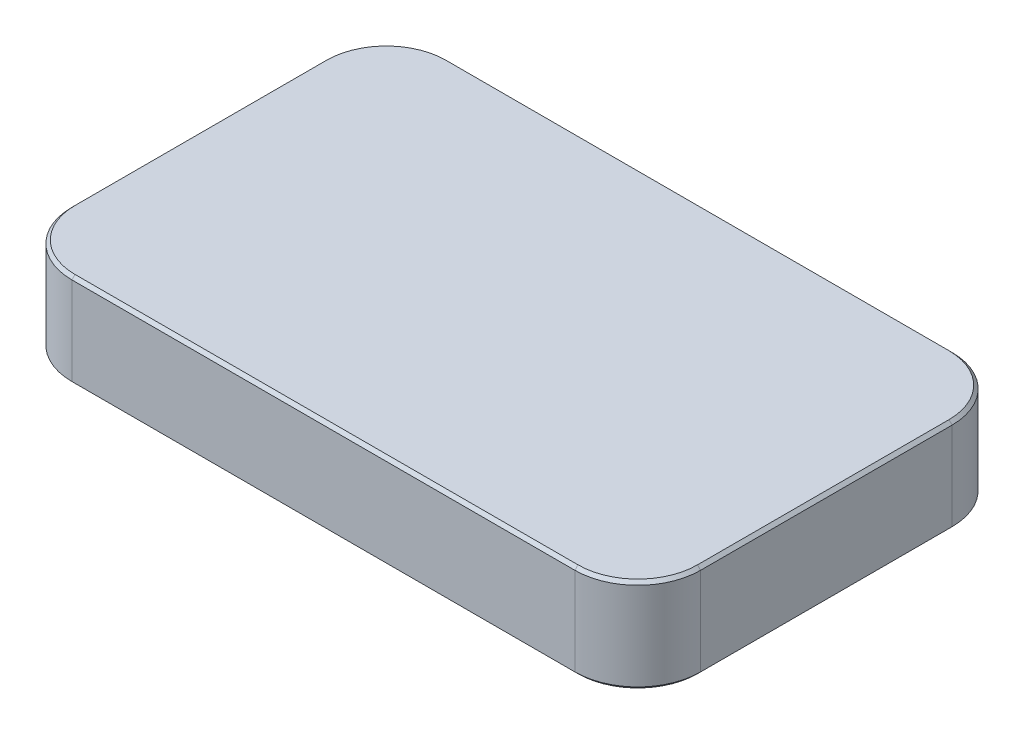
from build123d import *

# Parameters (mm, degrees)
SKETCH1_W      = 127
SKETCH1_H      = 76.2
EXTRUDE1_DEPTH = 19.05
FILLET1_R      = 12.7
CHAMFER1_SIZE  = 0.635


with BuildPart() as part:
    # Sketch1 → Extrude1 (new body)
    with BuildSketch(Plane(origin=(0, 0, 0), x_dir=(1, 0, 0), z_dir=(0, 1, 0))):
        Rectangle(SKETCH1_W, SKETCH1_H)
    extrude(amount=EXTRUDE1_DEPTH)

    # Fillet1
    fillet1_edges = [part.edges().sort_by_distance(p)[0] for p in [
        (-63.5, 9.525, -38.1),
        (63.5, 9.525, -38.1),
        (63.5, 9.525, 38.1),
        (-63.5, 9.525, 38.1),
    ]]
    fillet(fillet1_edges, radius=FILLET1_R)

    # Chamfer1
    chamfer1_edges = [part.edges().sort_by_distance(p)[0] for p in [
        (-63.5, 0, 0),
        (-63.5, 19.05, 0),
        (0, 0, -38.1),
        (63.5, 0, 0),
        (0, 0, 38.1),
        (59.780256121, 0, 34.380256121),
        (-59.780256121, 0, 34.380256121),
        (59.780256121, 0, -34.380256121),
        (-59.780256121, 0, -34.380256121),
        (0, 19.05, -38.1),
        (0, 19.05, 38.1),
        (63.5, 19.05, 0),
        (59.780256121, 19.05, 34.380256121),
        (-59.780256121, 19.05, 34.380256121),
        (59.780256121, 19.05, -34.380256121),
        (-59.780256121, 19.05, -34.380256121),
    ]]
    chamfer(chamfer1_edges, length=CHAMFER1_SIZE)


solid = part.part
